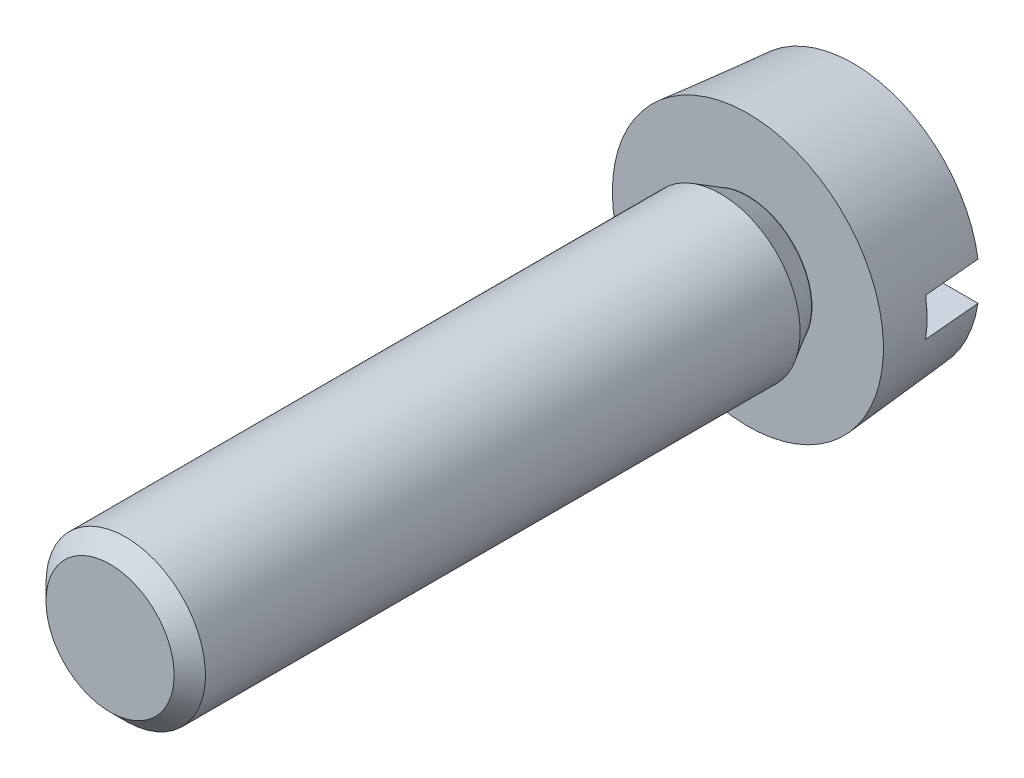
ISO-10303-21;
HEADER;
FILE_DESCRIPTION(('STEP AP214'),'2;1');
FILE_NAME('part.step','',(''),(''),'','','');
FILE_SCHEMA(('AUTOMOTIVE_DESIGN { 1 0 10303 214 1 1 1 1 }'));
ENDSEC;
DATA;
#1=APPLICATION_CONTEXT('core data for automotive mechanical design processes');
#2=APPLICATION_PROTOCOL_DEFINITION('international standard','automotive_design',2000,#1);
#3=PRODUCT_CONTEXT('',#1,'mechanical');
#4=PRODUCT('Part','Part','',(#3));
#5=PRODUCT_RELATED_PRODUCT_CATEGORY('part','',(#4));
#6=PRODUCT_DEFINITION_FORMATION('','',#4);
#7=PRODUCT_DEFINITION_CONTEXT('part definition',#1,'design');
#8=PRODUCT_DEFINITION('design','',#6,#7);
#9=PRODUCT_DEFINITION_SHAPE('','',#8);
#10=(LENGTH_UNIT() NAMED_UNIT(*) SI_UNIT(.MILLI.,.METRE.));
#11=(NAMED_UNIT(*) PLANE_ANGLE_UNIT() SI_UNIT($,.RADIAN.));
#12=(NAMED_UNIT(*) SI_UNIT($,.STERADIAN.) SOLID_ANGLE_UNIT());
#13=UNCERTAINTY_MEASURE_WITH_UNIT(LENGTH_MEASURE(1.E-05),#10,'distance_accuracy_value','');
#14=(GEOMETRIC_REPRESENTATION_CONTEXT(3) GLOBAL_UNCERTAINTY_ASSIGNED_CONTEXT((#13)) GLOBAL_UNIT_ASSIGNED_CONTEXT((#10,
#11,#12)) REPRESENTATION_CONTEXT('',''));
#15=CARTESIAN_POINT('',(0.,0.,0.));
#16=DIRECTION('',(0.,0.,1.));
#17=DIRECTION('',(1.,0.,0.));
#18=AXIS2_PLACEMENT_3D('',#15,#16,#17);
#19=CARTESIAN_POINT('',(15.,22.5,-83.5));
#20=DIRECTION('',(0.,0.,1.));
#21=DIRECTION('',(1.,0.,0.));
#22=AXIS2_PLACEMENT_3D('',#19,#20,#21);
#23=PLANE('',#22);
#24=DIRECTION('',(1.,0.,0.));
#25=VECTOR('',#24,1.);
#26=CARTESIAN_POINT('',(15.,21.9,-83.5));
#27=LINE('',#26,#25);
#28=CARTESIAN_POINT('',(10.9251697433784,21.9,-83.4999999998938));
#29=VERTEX_POINT('',#28);
#30=CARTESIAN_POINT('',(19.0748302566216,21.9,-83.4999999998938));
#31=VERTEX_POINT('',#30);
#32=EDGE_CURVE('E75',#29,#31,#27,.T.);
#33=ORIENTED_EDGE('',*,*,#32,.F.);
#34=CARTESIAN_POINT('',(15.,22.5,-83.4999999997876));
#35=DIRECTION('',(0.,0.,1.));
#36=DIRECTION('',(1.,0.,0.));
#37=AXIS2_PLACEMENT_3D('',#34,#35,#36);
#38=CIRCLE('',#37,4.11876700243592);
#39=CARTESIAN_POINT('',(10.9251697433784,23.1,-83.4999999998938));
#40=VERTEX_POINT('',#39);
#41=EDGE_CURVE('E19',#40,#29,#38,.T.);
#42=ORIENTED_EDGE('',*,*,#41,.F.);
#43=DIRECTION('',(1.,0.,0.));
#44=VECTOR('',#43,1.);
#45=CARTESIAN_POINT('',(15.,23.1,-83.5));
#46=LINE('',#45,#44);
#47=CARTESIAN_POINT('',(19.0748302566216,23.1,-83.4999999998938));
#48=VERTEX_POINT('',#47);
#49=EDGE_CURVE('E79',#48,#40,#46,.F.);
#50=ORIENTED_EDGE('',*,*,#49,.F.);
#51=CARTESIAN_POINT('',(15.,22.5,-83.4999999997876));
#52=DIRECTION('',(0.,0.,1.));
#53=DIRECTION('',(1.,0.,0.));
#54=AXIS2_PLACEMENT_3D('',#51,#52,#53);
#55=CIRCLE('',#54,4.11876700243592);
#56=EDGE_CURVE('E73',#31,#48,#55,.T.);
#57=ORIENTED_EDGE('',*,*,#56,.F.);
#58=EDGE_LOOP('',(#33,#42,#50,#57));
#59=FACE_BOUND('',#58,.T.);
#60=ADVANCED_FACE('F16',(#59),#23,.F.);
#61=CARTESIAN_POINT('',(15.,22.5,-85.3));
#62=DIRECTION('',(0.,0.,1.));
#63=DIRECTION('',(1.,0.,0.));
#64=AXIS2_PLACEMENT_3D('',#61,#62,#63);
#65=PLANE('',#64);
#66=CARTESIAN_POINT('',(15.,22.5,-85.2999999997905));
#67=DIRECTION('',(0.,0.,1.));
#68=DIRECTION('',(1.,0.,0.));
#69=AXIS2_PLACEMENT_3D('',#66,#67,#68);
#70=CIRCLE('',#69,3.9612874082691);
#71=CARTESIAN_POINT('',(11.0844160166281,21.9,-85.2999999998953));
#72=VERTEX_POINT('',#71);
#73=CARTESIAN_POINT('',(18.9155839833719,21.9,-85.2999999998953));
#74=VERTEX_POINT('',#73);
#75=EDGE_CURVE('E84',#72,#74,#70,.T.);
#76=ORIENTED_EDGE('',*,*,#75,.F.);
#77=DIRECTION('',(1.,0.,0.));
#78=VECTOR('',#77,1.);
#79=CARTESIAN_POINT('',(15.,21.9,-85.3));
#80=LINE('',#79,#78);
#81=EDGE_CURVE('E80',#74,#72,#80,.F.);
#82=ORIENTED_EDGE('',*,*,#81,.F.);
#83=EDGE_LOOP('',(#76,#82));
#84=FACE_BOUND('',#83,.T.);
#85=ADVANCED_FACE('F103',(#84),#65,.F.);
#86=CARTESIAN_POINT('',(15.,21.9,-84.4));
#87=DIRECTION('',(0.,1.,0.));
#88=DIRECTION('',(0.,0.,1.));
#89=AXIS2_PLACEMENT_3D('',#86,#87,#88);
#90=PLANE('',#89);
#91=CARTESIAN_POINT('',(10.9251697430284,21.8999999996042,-83.4999999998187));
#92=CARTESIAN_POINT('',(10.9516992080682,21.8999999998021,-83.8000010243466));
#93=CARTESIAN_POINT('',(10.9782344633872,21.899999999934,-84.1000015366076));
#94=CARTESIAN_POINT('',(11.0313165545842,21.900000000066,-84.7000015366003));
#95=CARTESIAN_POINT('',(11.0578633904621,21.900000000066,-85.000001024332));
#96=CARTESIAN_POINT('',(11.0844160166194,21.9,-85.2999999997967));
#97=B_SPLINE_CURVE_WITH_KNOTS('',3,(#91,#92,#93,#94,#95,#96),.UNSPECIFIED.,.F.,.F.,(4,2,4),(0.,
0.903515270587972,1.80703054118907),.UNSPECIFIED.);
#98=EDGE_CURVE('E70',#29,#72,#97,.T.);
#99=ORIENTED_EDGE('',*,*,#98,.F.);
#100=ORIENTED_EDGE('',*,*,#32,.T.);
#101=CARTESIAN_POINT('',(18.9155839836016,21.8999999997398,-85.2999999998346));
#102=CARTESIAN_POINT('',(18.9421366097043,21.8999999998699,-85.0000010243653));
#103=CARTESIAN_POINT('',(18.968683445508,21.8999999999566,-84.7000015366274));
#104=CARTESIAN_POINT('',(19.0217655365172,21.9000000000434,-84.1000015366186));
#105=CARTESIAN_POINT('',(19.0483007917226,21.9000000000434,-83.8000010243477));
#106=CARTESIAN_POINT('',(19.0748302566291,21.9,-83.4999999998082));
#107=B_SPLINE_CURVE_WITH_KNOTS('',3,(#101,#102,#103,#104,#105,#106),.UNSPECIFIED.,.F.,.F.,(4,2,
4),(0.,0.90351527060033,1.80703054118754),.UNSPECIFIED.);
#108=EDGE_CURVE('E87',#74,#31,#107,.T.);
#109=ORIENTED_EDGE('',*,*,#108,.F.);
#110=ORIENTED_EDGE('',*,*,#81,.T.);
#111=EDGE_LOOP('',(#99,#100,#109,#110));
#112=FACE_BOUND('',#111,.T.);
#113=ADVANCED_FACE('F82',(#112),#90,.T.);
#114=CARTESIAN_POINT('',(15.,22.5,-85.3));
#115=DIRECTION('',(0.,0.,1.));
#116=DIRECTION('',(1.,0.,0.));
#117=AXIS2_PLACEMENT_3D('',#114,#115,#116);
#118=PLANE('',#117);
#119=CARTESIAN_POINT('',(15.,22.5,-85.2999999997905));
#120=DIRECTION('',(0.,0.,1.));
#121=DIRECTION('',(1.,0.,0.));
#122=AXIS2_PLACEMENT_3D('',#119,#120,#121);
#123=CIRCLE('',#122,3.9612874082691);
#124=CARTESIAN_POINT('',(18.9155839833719,23.1,-85.2999999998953));
#125=VERTEX_POINT('',#124);
#126=CARTESIAN_POINT('',(11.0844160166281,23.1,-85.2999999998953));
#127=VERTEX_POINT('',#126);
#128=EDGE_CURVE('E115',#125,#127,#123,.T.);
#129=ORIENTED_EDGE('',*,*,#128,.F.);
#130=DIRECTION('',(1.,0.,0.));
#131=VECTOR('',#130,1.);
#132=CARTESIAN_POINT('',(15.,23.1,-85.3));
#133=LINE('',#132,#131);
#134=EDGE_CURVE('E85',#127,#125,#133,.T.);
#135=ORIENTED_EDGE('',*,*,#134,.F.);
#136=EDGE_LOOP('',(#129,#135));
#137=FACE_BOUND('',#136,.T.);
#138=ADVANCED_FACE('F102',(#137),#118,.F.);
#139=CARTESIAN_POINT('',(15.,23.1,-84.4));
#140=DIRECTION('',(0.,-1.,0.));
#141=DIRECTION('',(0.,0.,-1.));
#142=AXIS2_PLACEMENT_3D('',#139,#140,#141);
#143=PLANE('',#142);
#144=CARTESIAN_POINT('',(11.0844160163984,23.1000000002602,-85.2999999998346));
#145=CARTESIAN_POINT('',(11.0578633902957,23.1000000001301,-85.0000010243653));
#146=CARTESIAN_POINT('',(11.031316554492,23.1000000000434,-84.7000015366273));
#147=CARTESIAN_POINT('',(10.9782344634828,23.0999999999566,-84.1000015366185));
#148=CARTESIAN_POINT('',(10.9516992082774,23.0999999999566,-83.8000010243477));
#149=CARTESIAN_POINT('',(10.9251697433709,23.1,-83.4999999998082));
#150=B_SPLINE_CURVE_WITH_KNOTS('',3,(#144,#145,#146,#147,#148,#149),.UNSPECIFIED.,.F.,.F.,(4,2,
4),(0.,0.903515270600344,1.80703054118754),.UNSPECIFIED.);
#151=EDGE_CURVE('E72',#127,#40,#150,.T.);
#152=ORIENTED_EDGE('',*,*,#151,.F.);
#153=ORIENTED_EDGE('',*,*,#134,.T.);
#154=CARTESIAN_POINT('',(19.0748302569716,23.1000000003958,-83.4999999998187));
#155=CARTESIAN_POINT('',(19.0483007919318,23.1000000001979,-83.8000010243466));
#156=CARTESIAN_POINT('',(19.0217655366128,23.100000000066,-84.1000015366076));
#157=CARTESIAN_POINT('',(18.9686834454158,23.099999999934,-84.7000015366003));
#158=CARTESIAN_POINT('',(18.9421366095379,23.099999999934,-85.000001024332));
#159=CARTESIAN_POINT('',(18.9155839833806,23.1,-85.2999999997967));
#160=B_SPLINE_CURVE_WITH_KNOTS('',3,(#154,#155,#156,#157,#158,#159),.UNSPECIFIED.,.F.,.F.,(4,2,
4),(0.,0.903515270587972,1.80703054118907),.UNSPECIFIED.);
#161=EDGE_CURVE('E109',#48,#125,#160,.T.);
#162=ORIENTED_EDGE('',*,*,#161,.F.);
#163=ORIENTED_EDGE('',*,*,#49,.T.);
#164=EDGE_LOOP('',(#152,#153,#162,#163));
#165=FACE_BOUND('',#164,.T.);
#166=ADVANCED_FACE('F117',(#165),#143,.T.);
#167=CARTESIAN_POINT('',(15.,22.5,-81.9999999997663));
#168=DIRECTION('',(0.,0.,1.));
#169=DIRECTION('',(1.,0.,0.));
#170=AXIS2_PLACEMENT_3D('',#167,#168,#169);
#171=CONICAL_SURFACE('',#170,4.2499999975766,0.0872664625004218);
#172=CARTESIAN_POINT('',(15.,22.5,-81.9999999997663));
#173=DIRECTION('',(0.,0.,1.));
#174=DIRECTION('',(1.,0.,0.));
#175=AXIS2_PLACEMENT_3D('',#172,#173,#174);
#176=CIRCLE('',#175,4.2499999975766);
#177=CARTESIAN_POINT('',(10.7500000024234,22.5,-81.9999999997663));
#178=VERTEX_POINT('',#177);
#179=EDGE_CURVE('E32',#178,#178,#176,.T.);
#180=ORIENTED_EDGE('',*,*,#179,.F.);
#181=EDGE_LOOP('',(#180));
#182=FACE_BOUND('',#181,.T.);
#183=ORIENTED_EDGE('',*,*,#128,.T.);
#184=ORIENTED_EDGE('',*,*,#151,.T.);
#185=ORIENTED_EDGE('',*,*,#41,.T.);
#186=ORIENTED_EDGE('',*,*,#98,.T.);
#187=ORIENTED_EDGE('',*,*,#75,.T.);
#188=ORIENTED_EDGE('',*,*,#108,.T.);
#189=ORIENTED_EDGE('',*,*,#56,.T.);
#190=ORIENTED_EDGE('',*,*,#161,.T.);
#191=EDGE_LOOP('',(#183,#184,#185,#186,#187,#188,#189,#190));
#192=FACE_BOUND('',#191,.T.);
#193=ADVANCED_FACE('F67',(#182,#192),#171,.T.);
#194=CARTESIAN_POINT('',(15.,22.5,-82.));
#195=DIRECTION('',(0.,0.,1.));
#196=DIRECTION('',(1.,0.,0.));
#197=AXIS2_PLACEMENT_3D('',#194,#195,#196);
#198=PLANE('',#197);
#199=CARTESIAN_POINT('',(15.,22.5,-82.));
#200=DIRECTION('',(0.,0.,-1.));
#201=DIRECTION('',(-1.,0.,0.));
#202=AXIS2_PLACEMENT_3D('',#199,#200,#201);
#203=CIRCLE('',#202,2.0095);
#204=CARTESIAN_POINT('',(12.9905,22.5,-82.));
#205=VERTEX_POINT('',#204);
#206=EDGE_CURVE('E127',#205,#205,#203,.F.);
#207=ORIENTED_EDGE('',*,*,#206,.F.);
#208=EDGE_LOOP('',(#207));
#209=FACE_BOUND('',#208,.T.);
#210=ORIENTED_EDGE('',*,*,#179,.T.);
#211=EDGE_LOOP('',(#210));
#212=FACE_BOUND('',#211,.T.);
#213=ADVANCED_FACE('F162',(#209,#212),#198,.T.);
#214=CARTESIAN_POINT('',(15.,22.5,-62.));
#215=DIRECTION('',(0.,0.,-1.));
#216=DIRECTION('',(-1.,0.,0.));
#217=AXIS2_PLACEMENT_3D('',#214,#215,#216);
#218=PLANE('',#217);
#219=CARTESIAN_POINT('',(15.,22.5,-62.0000000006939));
#220=DIRECTION('',(0.,0.,-1.));
#221=DIRECTION('',(0.,1.,0.));
#222=AXIS2_PLACEMENT_3D('',#219,#220,#221);
#223=CIRCLE('',#222,2.00949999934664);
#224=CARTESIAN_POINT('',(12.9905000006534,22.5,-62.0000000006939));
#225=VERTEX_POINT('',#224);
#226=EDGE_CURVE('E130',#225,#225,#223,.T.);
#227=ORIENTED_EDGE('',*,*,#226,.F.);
#228=EDGE_LOOP('',(#227));
#229=FACE_BOUND('',#228,.T.);
#230=ADVANCED_FACE('F160',(#229),#218,.F.);
#231=CARTESIAN_POINT('',(15.,22.5,-81.57));
#232=DIRECTION('',(0.,0.,-1.));
#233=DIRECTION('',(-1.,0.,0.));
#234=AXIS2_PLACEMENT_3D('',#231,#232,#233);
#235=CYLINDRICAL_SURFACE('',#234,2.0095);
#236=ORIENTED_EDGE('',*,*,#206,.T.);
#237=EDGE_LOOP('',(#236));
#238=FACE_BOUND('',#237,.T.);
#239=CARTESIAN_POINT('',(15.,22.5,-81.989570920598));
#240=DIRECTION('',(0.,0.,1.));
#241=DIRECTION('',(1.,0.,0.));
#242=AXIS2_PLACEMENT_3D('',#239,#240,#241);
#243=CIRCLE('',#242,2.00949999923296);
#244=CARTESIAN_POINT('',(12.9905000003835,22.5,-81.9895709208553));
#245=VERTEX_POINT('',#244);
#246=EDGE_CURVE('E132',#245,#245,#243,.T.);
#247=ORIENTED_EDGE('',*,*,#246,.F.);
#248=EDGE_LOOP('',(#247));
#249=FACE_BOUND('',#248,.T.);
#250=ADVANCED_FACE('F156',(#238,#249),#235,.T.);
#251=CARTESIAN_POINT('',(15.,22.5,-62.490500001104));
#252=DIRECTION('',(0.,0.,-1.));
#253=DIRECTION('',(0.,1.,0.));
#254=AXIS2_PLACEMENT_3D('',#251,#252,#253);
#255=CONICAL_SURFACE('',#254,2.49999999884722,0.785398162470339);
#256=CARTESIAN_POINT('',(15.,22.5,-62.4905));
#257=DIRECTION('',(0.,0.,-1.));
#258=DIRECTION('',(-1.,0.,0.));
#259=AXIS2_PLACEMENT_3D('',#256,#257,#258);
#260=CIRCLE('',#259,2.5);
#261=CARTESIAN_POINT('',(12.5000000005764,22.5,-62.490500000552));
#262=VERTEX_POINT('',#261);
#263=EDGE_CURVE('E25',#262,#262,#260,.T.);
#264=ORIENTED_EDGE('',*,*,#263,.F.);
#265=EDGE_LOOP('',(#264));
#266=FACE_BOUND('',#265,.T.);
#267=ORIENTED_EDGE('',*,*,#226,.T.);
#268=EDGE_LOOP('',(#267));
#269=FACE_BOUND('',#268,.T.);
#270=ADVANCED_FACE('F152',(#266,#269),#255,.T.);
#271=CARTESIAN_POINT('',(15.,22.5,-81.1399999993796));
#272=DIRECTION('',(0.,0.,1.));
#273=DIRECTION('',(1.,0.,0.));
#274=AXIS2_PLACEMENT_3D('',#271,#272,#273);
#275=CONICAL_SURFACE('',#274,2.49999999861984,0.523598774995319);
#276=CARTESIAN_POINT('',(15.,22.5,-81.14));
#277=DIRECTION('',(0.,0.,-1.));
#278=DIRECTION('',(-1.,0.,0.));
#279=AXIS2_PLACEMENT_3D('',#276,#277,#278);
#280=CIRCLE('',#279,2.5);
#281=CARTESIAN_POINT('',(12.5000000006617,22.5,-81.139999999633));
#282=VERTEX_POINT('',#281);
#283=EDGE_CURVE('E11',#282,#282,#280,.F.);
#284=ORIENTED_EDGE('',*,*,#283,.F.);
#285=EDGE_LOOP('',(#284));
#286=FACE_BOUND('',#285,.T.);
#287=ORIENTED_EDGE('',*,*,#246,.T.);
#288=EDGE_LOOP('',(#287));
#289=FACE_BOUND('',#288,.T.);
#290=ADVANCED_FACE('F155',(#286,#289),#275,.T.);
#291=CARTESIAN_POINT('',(15.,22.5,-71.81525));
#292=DIRECTION('',(0.,0.,-1.));
#293=DIRECTION('',(-1.,0.,0.));
#294=AXIS2_PLACEMENT_3D('',#291,#292,#293);
#295=CYLINDRICAL_SURFACE('',#294,2.5);
#296=ORIENTED_EDGE('',*,*,#283,.T.);
#297=EDGE_LOOP('',(#296));
#298=FACE_BOUND('',#297,.T.);
#299=ORIENTED_EDGE('',*,*,#263,.T.);
#300=EDGE_LOOP('',(#299));
#301=FACE_BOUND('',#300,.T.);
#302=ADVANCED_FACE('F148',(#298,#301),#295,.T.);
#303=CLOSED_SHELL('',(#60,#85,#113,#138,#166,#193,#213,#230,#250,#270,#290,#302));
#304=MANIFOLD_SOLID_BREP('B1',#303);
#305=ADVANCED_BREP_SHAPE_REPRESENTATION('',(#18,#304),#14);
#306=SHAPE_DEFINITION_REPRESENTATION(#9,#305);
ENDSEC;
END-ISO-10303-21;
